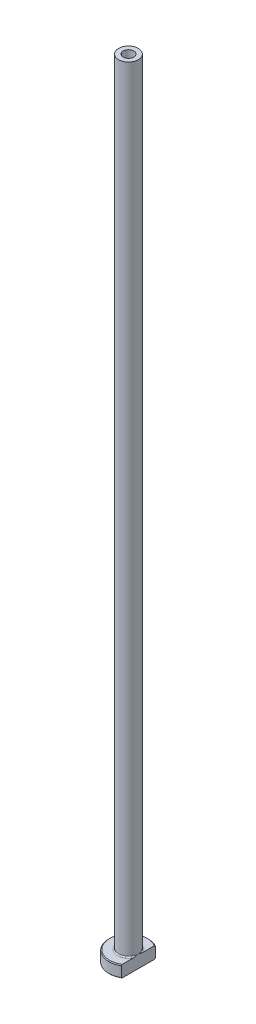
from build123d import *

# Parameters (mm, degrees)
FILLET1_R          = 0.3
CHAMFER1_SIZE      = 0.2
CUT_EXTRUDE1_DEPTH = 201.124960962
CHAMFER2_SIZE      = 0.5


with BuildPart() as part:
    # Sketch1 → Revolve1 (revolve)
    with BuildSketch(Plane.XY, mode=Mode.PRIVATE) as revolve1_sk:
        Polygon((-1.35, 200), (-2.5, 200), (-2.5, 3), (-5, 3), (-5, 0), (-1.6, 0), (-1.6, 143), (-1.35, 155), align=None)
    revolve(revolve1_sk.sketch.rotate(Axis((0, 92.187680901, 0), (0, -1, 0)), 270), axis=Axis((0, 92.187680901, 0), (0, -1, 0)))

    # Fillet1
    fillet1_edges = [part.edges().sort_by_distance(p)[0] for p in [
        (0, 3, -2.5),
    ]]
    fillet(fillet1_edges, radius=FILLET1_R)

    # Chamfer1
    chamfer1_edges = [part.edges().sort_by_distance(p)[0] for p in [
        (0, 0, -5),
        (0, 3, -5),
    ]]
    chamfer(chamfer1_edges, length=CHAMFER1_SIZE)

    # Sketch2 → Cut-Extrude1 (cut, through all)
    with BuildSketch(Plane.XZ):
        with BuildLine():
            Line((2.5, 4.330127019), (2.5, -4.330127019))
            ThreePointArc((2.5, -4.330127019), (5, 0), (2.5, 4.330127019))
        make_face()
    extrude(amount=-CUT_EXTRUDE1_DEPTH, mode=Mode.SUBTRACT)

    # Chamfer2
    chamfer2_edges = [part.edges().sort_by_distance(p)[0] for p in [
        (0, 0, -1.6),
    ]]
    chamfer(chamfer2_edges, length=CHAMFER2_SIZE)


solid = part.part
